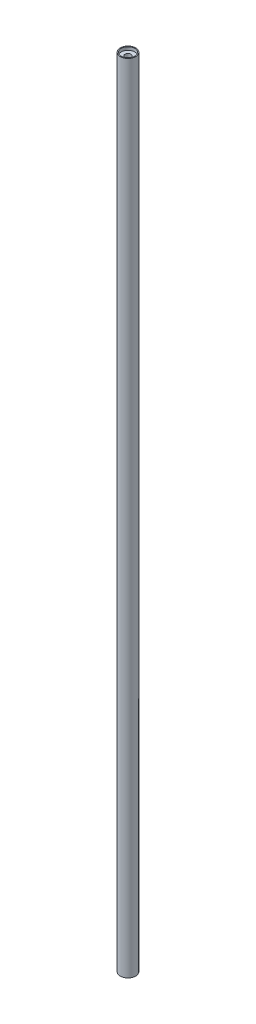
ISO-10303-21;
HEADER;
FILE_DESCRIPTION(('STEP AP214'),'2;1');
FILE_NAME('part.step','',(''),(''),'','','');
FILE_SCHEMA(('AUTOMOTIVE_DESIGN { 1 0 10303 214 1 1 1 1 }'));
ENDSEC;
DATA;
#1=APPLICATION_CONTEXT('core data for automotive mechanical design processes');
#2=APPLICATION_PROTOCOL_DEFINITION('international standard','automotive_design',2000,#1);
#3=PRODUCT_CONTEXT('',#1,'mechanical');
#4=PRODUCT('Part','Part','',(#3));
#5=PRODUCT_RELATED_PRODUCT_CATEGORY('part','',(#4));
#6=PRODUCT_DEFINITION_FORMATION('','',#4);
#7=PRODUCT_DEFINITION_CONTEXT('part definition',#1,'design');
#8=PRODUCT_DEFINITION('design','',#6,#7);
#9=PRODUCT_DEFINITION_SHAPE('','',#8);
#10=(LENGTH_UNIT() NAMED_UNIT(*) SI_UNIT(.MILLI.,.METRE.));
#11=(NAMED_UNIT(*) PLANE_ANGLE_UNIT() SI_UNIT($,.RADIAN.));
#12=(NAMED_UNIT(*) SI_UNIT($,.STERADIAN.) SOLID_ANGLE_UNIT());
#13=UNCERTAINTY_MEASURE_WITH_UNIT(LENGTH_MEASURE(1.E-05),#10,'distance_accuracy_value','');
#14=(GEOMETRIC_REPRESENTATION_CONTEXT(3) GLOBAL_UNCERTAINTY_ASSIGNED_CONTEXT((#13)) GLOBAL_UNIT_ASSIGNED_CONTEXT((#10,
#11,#12)) REPRESENTATION_CONTEXT('',''));
#15=CARTESIAN_POINT('',(0.,0.,0.));
#16=DIRECTION('',(0.,0.,1.));
#17=DIRECTION('',(1.,0.,0.));
#18=AXIS2_PLACEMENT_3D('',#15,#16,#17);
#19=CARTESIAN_POINT('',(0.,330.2,0.));
#20=DIRECTION('',(0.,-1.,0.));
#21=DIRECTION('',(0.,0.,-1.));
#22=AXIS2_PLACEMENT_3D('',#19,#20,#21);
#23=CYLINDRICAL_SURFACE('',#22,3.175);
#24=CARTESIAN_POINT('',(0.,330.2,0.));
#25=DIRECTION('',(0.,1.,0.));
#26=DIRECTION('',(0.,0.,1.));
#27=AXIS2_PLACEMENT_3D('',#24,#25,#26);
#28=CIRCLE('',#27,3.175);
#29=CARTESIAN_POINT('',(0.,330.2,3.175));
#30=VERTEX_POINT('',#29);
#31=EDGE_CURVE('E11',#30,#30,#28,.T.);
#32=ORIENTED_EDGE('',*,*,#31,.F.);
#33=EDGE_LOOP('',(#32));
#34=FACE_BOUND('',#33,.T.);
#35=CARTESIAN_POINT('',(0.,0.,0.));
#36=DIRECTION('',(0.,1.,0.));
#37=DIRECTION('',(0.,0.,1.));
#38=AXIS2_PLACEMENT_3D('',#35,#36,#37);
#39=CIRCLE('',#38,3.175);
#40=CARTESIAN_POINT('',(0.,0.,3.175));
#41=VERTEX_POINT('',#40);
#42=EDGE_CURVE('E48',#41,#41,#39,.T.);
#43=ORIENTED_EDGE('',*,*,#42,.T.);
#44=EDGE_LOOP('',(#43));
#45=FACE_BOUND('',#44,.T.);
#46=ADVANCED_FACE('F45',(#34,#45),#23,.T.);
#47=CARTESIAN_POINT('',(0.,330.2,0.));
#48=DIRECTION('',(0.,1.,0.));
#49=DIRECTION('',(0.,0.,1.));
#50=AXIS2_PLACEMENT_3D('',#47,#48,#49);
#51=PLANE('',#50);
#52=CARTESIAN_POINT('',(0.,330.2,0.));
#53=DIRECTION('',(0.,1.,0.));
#54=DIRECTION('',(0.,0.,1.));
#55=AXIS2_PLACEMENT_3D('',#52,#53,#54);
#56=CIRCLE('',#55,2.77876);
#57=CARTESIAN_POINT('',(0.,330.2,2.77876));
#58=VERTEX_POINT('',#57);
#59=EDGE_CURVE('E207',#58,#58,#56,.T.);
#60=ORIENTED_EDGE('',*,*,#59,.F.);
#61=EDGE_LOOP('',(#60));
#62=FACE_BOUND('',#61,.T.);
#63=ORIENTED_EDGE('',*,*,#31,.T.);
#64=EDGE_LOOP('',(#63));
#65=FACE_BOUND('',#64,.T.);
#66=ADVANCED_FACE('F103',(#62,#65),#51,.T.);
#67=CARTESIAN_POINT('',(0.,0.,0.));
#68=DIRECTION('',(0.,1.,0.));
#69=DIRECTION('',(0.,0.,1.));
#70=AXIS2_PLACEMENT_3D('',#67,#68,#69);
#71=PLANE('',#70);
#72=CARTESIAN_POINT('',(0.,0.,0.));
#73=DIRECTION('',(0.,-1.,0.));
#74=DIRECTION('',(0.,0.,-1.));
#75=AXIS2_PLACEMENT_3D('',#72,#73,#74);
#76=CIRCLE('',#75,1.5875);
#77=CARTESIAN_POINT('',(0.,0.,-1.5875));
#78=VERTEX_POINT('',#77);
#79=EDGE_CURVE('E70',#78,#78,#76,.T.);
#80=ORIENTED_EDGE('',*,*,#79,.F.);
#81=EDGE_LOOP('',(#80));
#82=FACE_BOUND('',#81,.T.);
#83=ORIENTED_EDGE('',*,*,#42,.F.);
#84=EDGE_LOOP('',(#83));
#85=FACE_BOUND('',#84,.T.);
#86=ADVANCED_FACE('F100',(#82,#85),#71,.F.);
#87=CARTESIAN_POINT('',(0.,6.35,0.));
#88=DIRECTION('',(0.,-1.,0.));
#89=DIRECTION('',(0.,0.,-1.));
#90=AXIS2_PLACEMENT_3D('',#87,#88,#89);
#91=CONICAL_SURFACE('',#90,0.698499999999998,1.02974425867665);
#92=CARTESIAN_POINT('',(0.,6.76970114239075,0.));
#93=VERTEX_POINT('',#92);
#94=VERTEX_LOOP('',#93);
#95=FACE_BOUND('',#94,.T.);
#96=CARTESIAN_POINT('',(0.,6.35,0.));
#97=DIRECTION('',(0.,-1.,0.));
#98=DIRECTION('',(0.,0.,-1.));
#99=AXIS2_PLACEMENT_3D('',#96,#97,#98);
#100=CIRCLE('',#99,0.698499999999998);
#101=CARTESIAN_POINT('',(0.,6.35,-0.698499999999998));
#102=VERTEX_POINT('',#101);
#103=EDGE_CURVE('E90',#102,#102,#100,.T.);
#104=ORIENTED_EDGE('',*,*,#103,.T.);
#105=EDGE_LOOP('',(#104));
#106=FACE_BOUND('',#105,.T.);
#107=ADVANCED_FACE('F102',(#95,#106),#91,.F.);
#108=CARTESIAN_POINT('',(0.,0.,0.));
#109=DIRECTION('',(0.,-1.,0.));
#110=DIRECTION('',(0.,0.,-1.));
#111=AXIS2_PLACEMENT_3D('',#108,#109,#110);
#112=CYLINDRICAL_SURFACE('',#111,0.698499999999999);
#113=ORIENTED_EDGE('',*,*,#103,.F.);
#114=EDGE_LOOP('',(#113));
#115=FACE_BOUND('',#114,.T.);
#116=CARTESIAN_POINT('',(0.,0.711199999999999,0.));
#117=DIRECTION('',(0.,-1.,0.));
#118=DIRECTION('',(0.,0.,-1.));
#119=AXIS2_PLACEMENT_3D('',#116,#117,#118);
#120=CIRCLE('',#119,0.698499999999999);
#121=CARTESIAN_POINT('',(0.,0.711199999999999,-0.698499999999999));
#122=VERTEX_POINT('',#121);
#123=EDGE_CURVE('E86',#122,#122,#120,.T.);
#124=ORIENTED_EDGE('',*,*,#123,.T.);
#125=EDGE_LOOP('',(#124));
#126=FACE_BOUND('',#125,.T.);
#127=ADVANCED_FACE('F109',(#115,#126),#112,.F.);
#128=CARTESIAN_POINT('',(0.698499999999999,0.7112,0.));
#129=DIRECTION('',(0.,1.,0.));
#130=DIRECTION('',(0.,0.,1.));
#131=AXIS2_PLACEMENT_3D('',#128,#129,#130);
#132=PLANE('',#131);
#133=ORIENTED_EDGE('',*,*,#123,.F.);
#134=EDGE_LOOP('',(#133));
#135=FACE_BOUND('',#134,.T.);
#136=CARTESIAN_POINT('',(0.,0.7112,0.));
#137=DIRECTION('',(0.,-1.,0.));
#138=DIRECTION('',(0.,0.,-1.));
#139=AXIS2_PLACEMENT_3D('',#136,#137,#138);
#140=CIRCLE('',#139,1.5875);
#141=CARTESIAN_POINT('',(0.,0.7112,-1.5875));
#142=VERTEX_POINT('',#141);
#143=EDGE_CURVE('E76',#142,#142,#140,.T.);
#144=ORIENTED_EDGE('',*,*,#143,.T.);
#145=EDGE_LOOP('',(#144));
#146=FACE_BOUND('',#145,.T.);
#147=ADVANCED_FACE('F147',(#135,#146),#132,.F.);
#148=CARTESIAN_POINT('',(0.,0.,0.));
#149=DIRECTION('',(0.,-1.,0.));
#150=DIRECTION('',(0.,0.,-1.));
#151=AXIS2_PLACEMENT_3D('',#148,#149,#150);
#152=CYLINDRICAL_SURFACE('',#151,1.5875);
#153=ORIENTED_EDGE('',*,*,#143,.F.);
#154=EDGE_LOOP('',(#153));
#155=FACE_BOUND('',#154,.T.);
#156=ORIENTED_EDGE('',*,*,#79,.T.);
#157=EDGE_LOOP('',(#156));
#158=FACE_BOUND('',#157,.T.);
#159=ADVANCED_FACE('F63',(#155,#158),#152,.F.);
#160=CARTESIAN_POINT('',(0.,323.85,0.));
#161=DIRECTION('',(0.,1.,0.));
#162=DIRECTION('',(0.,0.,1.));
#163=AXIS2_PLACEMENT_3D('',#160,#161,#162);
#164=CONICAL_SURFACE('',#163,1.2192,1.02974425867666);
#165=CARTESIAN_POINT('',(0.,323.117430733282,0.));
#166=VERTEX_POINT('',#165);
#167=VERTEX_LOOP('',#166);
#168=FACE_BOUND('',#167,.T.);
#169=CARTESIAN_POINT('',(0.,323.85,0.));
#170=DIRECTION('',(0.,1.,0.));
#171=DIRECTION('',(0.,0.,1.));
#172=AXIS2_PLACEMENT_3D('',#169,#170,#171);
#173=CIRCLE('',#172,1.2192);
#174=CARTESIAN_POINT('',(0.,323.85,1.2192));
#175=VERTEX_POINT('',#174);
#176=EDGE_CURVE('E67',#175,#175,#173,.T.);
#177=ORIENTED_EDGE('',*,*,#176,.T.);
#178=EDGE_LOOP('',(#177));
#179=FACE_BOUND('',#178,.T.);
#180=ADVANCED_FACE('F59',(#168,#179),#164,.F.);
#181=CARTESIAN_POINT('',(0.,330.2,0.));
#182=DIRECTION('',(0.,1.,0.));
#183=DIRECTION('',(0.,0.,1.));
#184=AXIS2_PLACEMENT_3D('',#181,#182,#183);
#185=CYLINDRICAL_SURFACE('',#184,1.2192);
#186=ORIENTED_EDGE('',*,*,#176,.F.);
#187=EDGE_LOOP('',(#186));
#188=FACE_BOUND('',#187,.T.);
#189=CARTESIAN_POINT('',(0.,328.93,0.));
#190=DIRECTION('',(0.,1.,0.));
#191=DIRECTION('',(0.,0.,1.));
#192=AXIS2_PLACEMENT_3D('',#189,#190,#191);
#193=CIRCLE('',#192,1.2192);
#194=CARTESIAN_POINT('',(0.,328.93,1.2192));
#195=VERTEX_POINT('',#194);
#196=EDGE_CURVE('E71',#195,#195,#193,.T.);
#197=ORIENTED_EDGE('',*,*,#196,.T.);
#198=EDGE_LOOP('',(#197));
#199=FACE_BOUND('',#198,.T.);
#200=ADVANCED_FACE('F62',(#188,#199),#185,.F.);
#201=CARTESIAN_POINT('',(1.2192,328.93,0.));
#202=DIRECTION('',(0.,-1.,0.));
#203=DIRECTION('',(0.,0.,-1.));
#204=AXIS2_PLACEMENT_3D('',#201,#202,#203);
#205=PLANE('',#204);
#206=ORIENTED_EDGE('',*,*,#196,.F.);
#207=EDGE_LOOP('',(#206));
#208=FACE_BOUND('',#207,.T.);
#209=CARTESIAN_POINT('',(0.,328.93,0.));
#210=DIRECTION('',(0.,1.,0.));
#211=DIRECTION('',(0.,0.,1.));
#212=AXIS2_PLACEMENT_3D('',#209,#210,#211);
#213=CIRCLE('',#212,2.77876);
#214=CARTESIAN_POINT('',(0.,328.93,2.77876));
#215=VERTEX_POINT('',#214);
#216=EDGE_CURVE('E79',#215,#215,#213,.T.);
#217=ORIENTED_EDGE('',*,*,#216,.T.);
#218=EDGE_LOOP('',(#217));
#219=FACE_BOUND('',#218,.T.);
#220=ADVANCED_FACE('F180',(#208,#219),#205,.F.);
#221=CARTESIAN_POINT('',(0.,330.2,0.));
#222=DIRECTION('',(0.,1.,0.));
#223=DIRECTION('',(0.,0.,1.));
#224=AXIS2_PLACEMENT_3D('',#221,#222,#223);
#225=CYLINDRICAL_SURFACE('',#224,2.77876);
#226=ORIENTED_EDGE('',*,*,#216,.F.);
#227=EDGE_LOOP('',(#226));
#228=FACE_BOUND('',#227,.T.);
#229=ORIENTED_EDGE('',*,*,#59,.T.);
#230=EDGE_LOOP('',(#229));
#231=FACE_BOUND('',#230,.T.);
#232=ADVANCED_FACE('F189',(#228,#231),#225,.F.);
#233=CLOSED_SHELL('',(#46,#66,#86,#107,#127,#147,#159,#180,#200,#220,#232));
#234=MANIFOLD_SOLID_BREP('B2',#233);
#235=ADVANCED_BREP_SHAPE_REPRESENTATION('',(#18,#234),#14);
#236=SHAPE_DEFINITION_REPRESENTATION(#9,#235);
ENDSEC;
END-ISO-10303-21;
